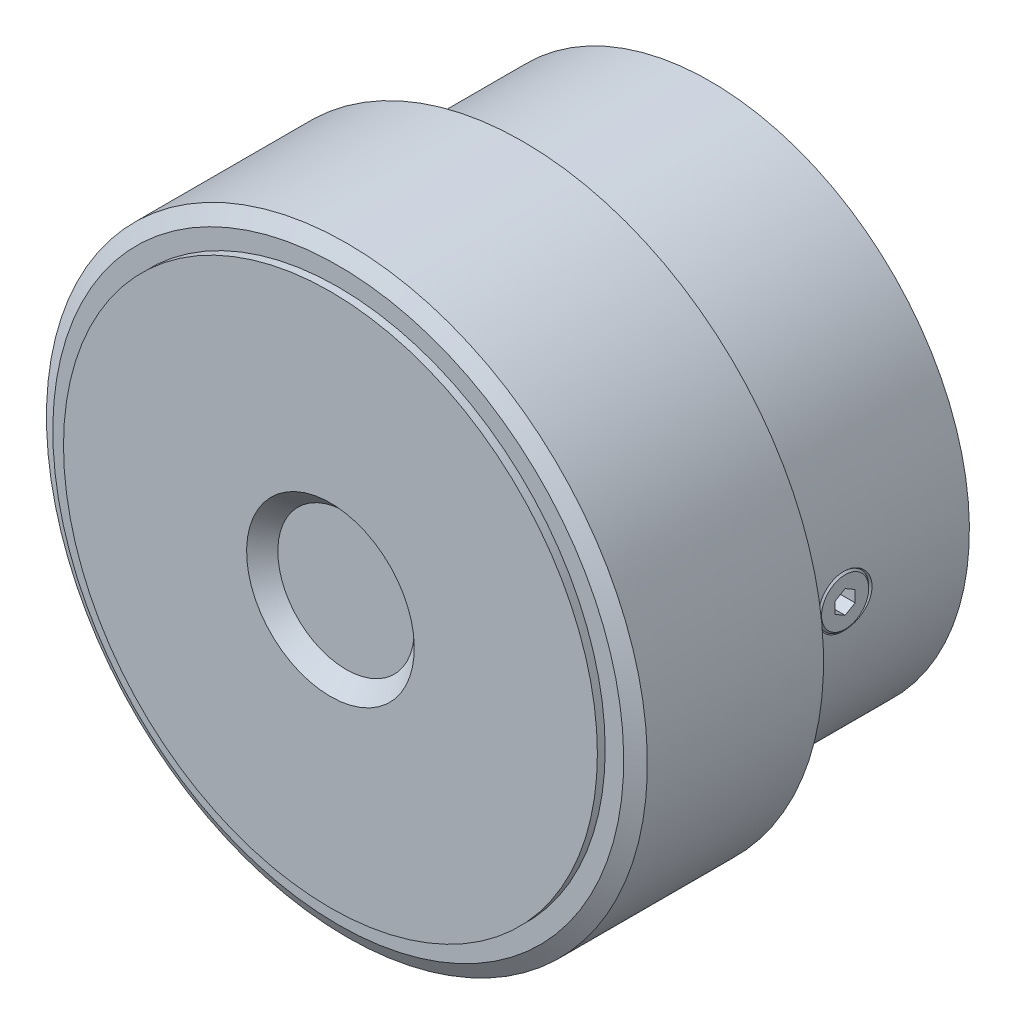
ISO-10303-21;
HEADER;
FILE_DESCRIPTION(('STEP AP214'),'2;1');
FILE_NAME('part.step','',(''),(''),'','','');
FILE_SCHEMA(('AUTOMOTIVE_DESIGN { 1 0 10303 214 1 1 1 1 }'));
ENDSEC;
DATA;
#1=APPLICATION_CONTEXT('core data for automotive mechanical design processes');
#2=APPLICATION_PROTOCOL_DEFINITION('international standard','automotive_design',2000,#1);
#3=PRODUCT_CONTEXT('',#1,'mechanical');
#4=PRODUCT('Part','Part','',(#3));
#5=PRODUCT_RELATED_PRODUCT_CATEGORY('part','',(#4));
#6=PRODUCT_DEFINITION_FORMATION('','',#4);
#7=PRODUCT_DEFINITION_CONTEXT('part definition',#1,'design');
#8=PRODUCT_DEFINITION('design','',#6,#7);
#9=PRODUCT_DEFINITION_SHAPE('','',#8);
#10=(LENGTH_UNIT() NAMED_UNIT(*) SI_UNIT(.MILLI.,.METRE.));
#11=(NAMED_UNIT(*) PLANE_ANGLE_UNIT() SI_UNIT($,.RADIAN.));
#12=(NAMED_UNIT(*) SI_UNIT($,.STERADIAN.) SOLID_ANGLE_UNIT());
#13=UNCERTAINTY_MEASURE_WITH_UNIT(LENGTH_MEASURE(1.E-05),#10,'distance_accuracy_value','');
#14=(GEOMETRIC_REPRESENTATION_CONTEXT(3) GLOBAL_UNCERTAINTY_ASSIGNED_CONTEXT((#13)) GLOBAL_UNIT_ASSIGNED_CONTEXT((#10,
#11,#12)) REPRESENTATION_CONTEXT('',''));
#15=CARTESIAN_POINT('',(0.,0.,0.));
#16=DIRECTION('',(0.,0.,1.));
#17=DIRECTION('',(1.,0.,0.));
#18=AXIS2_PLACEMENT_3D('',#15,#16,#17);
#19=CARTESIAN_POINT('',(17.45,0.,9.));
#20=DIRECTION('',(1.,0.,0.));
#21=DIRECTION('',(0.,0.,-1.));
#22=AXIS2_PLACEMENT_3D('',#19,#20,#21);
#23=CONICAL_SURFACE('',#22,2.,0.785398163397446);
#24=CARTESIAN_POINT('',(17.2061921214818,-1.22859785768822,7.7451063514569));
#25=CARTESIAN_POINT('',(17.2104098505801,-1.16952644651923,7.68137068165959));
#26=CARTESIAN_POINT('',(17.2146587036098,-1.10573725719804,7.62199444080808));
#27=CARTESIAN_POINT('',(17.2228450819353,-0.96991517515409,7.51346370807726));
#28=CARTESIAN_POINT('',(17.2267824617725,-0.897878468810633,7.46431397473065));
#29=CARTESIAN_POINT('',(17.2344139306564,-0.737976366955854,7.372427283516));
#30=CARTESIAN_POINT('',(17.2380219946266,-0.649249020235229,7.33116963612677));
#31=CARTESIAN_POINT('',(17.2439514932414,-0.465876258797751,7.26485773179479));
#32=CARTESIAN_POINT('',(17.24627290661,-0.371230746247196,7.2398037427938));
#33=CARTESIAN_POINT('',(17.249273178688,-0.183131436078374,7.20764057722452));
#34=CARTESIAN_POINT('',(17.2500187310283,-0.0898031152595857,7.19980220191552));
#35=CARTESIAN_POINT('',(17.2499805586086,0.0968043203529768,7.20020531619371));
#36=CARTESIAN_POINT('',(17.249197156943,0.190083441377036,7.2084434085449));
#37=CARTESIAN_POINT('',(17.2462249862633,0.371925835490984,7.2403300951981));
#38=CARTESIAN_POINT('',(17.2440658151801,0.460546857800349,7.26365428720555));
#39=CARTESIAN_POINT('',(17.2386081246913,0.632704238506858,7.32454932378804));
#40=CARTESIAN_POINT('',(17.2353095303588,0.716240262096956,7.36212110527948));
#41=CARTESIAN_POINT('',(17.2278575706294,0.877533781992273,7.45102359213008));
#42=CARTESIAN_POINT('',(17.2236900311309,0.95516190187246,7.50258737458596));
#43=CARTESIAN_POINT('',(17.2149764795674,1.10110874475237,7.61749740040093));
#44=CARTESIAN_POINT('',(17.2104303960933,1.16942570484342,7.68084586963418));
#45=CARTESIAN_POINT('',(17.2012193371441,1.2980367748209,7.82048865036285));
#46=CARTESIAN_POINT('',(17.1965579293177,1.35784573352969,7.89722987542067));
#47=CARTESIAN_POINT('',(17.1878114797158,1.4644122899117,8.05931965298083));
#48=CARTESIAN_POINT('',(17.1837265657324,1.51116699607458,8.144670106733));
#49=CARTESIAN_POINT('',(17.1763831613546,1.59251852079,8.32578252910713));
#50=CARTESIAN_POINT('',(17.1731714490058,1.62645551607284,8.42184307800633));
#51=CARTESIAN_POINT('',(17.1681818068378,1.67830719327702,8.61823209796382));
#52=CARTESIAN_POINT('',(17.1664041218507,1.69621913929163,8.71856129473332));
#53=CARTESIAN_POINT('',(17.1644443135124,1.71594236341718,8.92383024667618));
#54=CARTESIAN_POINT('',(17.1643112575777,1.71725853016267,9.02881834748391));
#55=CARTESIAN_POINT('',(17.1657834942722,1.70247747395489,9.23755670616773));
#56=CARTESIAN_POINT('',(17.1673889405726,1.68637871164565,9.34130685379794));
#57=CARTESIAN_POINT('',(17.172174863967,1.63692652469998,9.54539605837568));
#58=CARTESIAN_POINT('',(17.1753668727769,1.6034466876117,9.64570430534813));
#59=CARTESIAN_POINT('',(17.1829609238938,1.51990264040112,9.83912569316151));
#60=CARTESIAN_POINT('',(17.1873629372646,1.46983882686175,9.93223900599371));
#61=CARTESIAN_POINT('',(17.1967755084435,1.35523189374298,10.1069272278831));
#62=CARTESIAN_POINT('',(17.2017751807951,1.29093372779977,10.1886631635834));
#63=CARTESIAN_POINT('',(17.2118370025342,1.14900408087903,10.3396117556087));
#64=CARTESIAN_POINT('',(17.2168991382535,1.0713754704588,10.4088271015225));
#65=CARTESIAN_POINT('',(17.2262619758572,0.908186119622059,10.5297682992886));
#66=CARTESIAN_POINT('',(17.2305848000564,0.823057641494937,10.5820751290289));
#67=CARTESIAN_POINT('',(17.2381728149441,0.644848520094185,10.6708131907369));
#68=CARTESIAN_POINT('',(17.2414383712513,0.551770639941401,10.7072499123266));
#69=CARTESIAN_POINT('',(17.246371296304,0.365293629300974,10.7613802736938));
#70=CARTESIAN_POINT('',(17.2481100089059,0.27214022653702,10.7799152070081));
#71=CARTESIAN_POINT('',(17.2500515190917,0.0840215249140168,10.8005757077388));
#72=CARTESIAN_POINT('',(17.2502546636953,-0.010943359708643,10.8027049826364));
#73=CARTESIAN_POINT('',(17.2491202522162,-0.196755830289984,10.7906736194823));
#74=CARTESIAN_POINT('',(17.2478318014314,-0.287637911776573,10.7770321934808));
#75=CARTESIAN_POINT('',(17.2439395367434,-0.465827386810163,10.7348207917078));
#76=CARTESIAN_POINT('',(17.2413357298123,-0.55313479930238,10.7062508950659));
#77=CARTESIAN_POINT('',(17.2350798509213,-0.722313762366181,10.6350033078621));
#78=CARTESIAN_POINT('',(17.2314219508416,-0.804151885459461,10.5922469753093));
#79=CARTESIAN_POINT('',(17.2234529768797,-0.959819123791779,10.494100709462));
#80=CARTESIAN_POINT('',(17.2191418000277,-1.03364697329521,10.4387087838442));
#81=CARTESIAN_POINT('',(17.2101368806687,-1.17424275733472,10.3146606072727));
#82=CARTESIAN_POINT('',(17.2054348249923,-1.24063557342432,10.2455801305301));
#83=CARTESIAN_POINT('',(17.1962916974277,-1.36151974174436,10.0976817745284));
#84=CARTESIAN_POINT('',(17.1918506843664,-1.41600841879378,10.0188617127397));
#85=CARTESIAN_POINT('',(17.1834810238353,-1.51427760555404,9.84966040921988));
#86=CARTESIAN_POINT('',(17.1795871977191,-1.55741865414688,9.75890585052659));
#87=CARTESIAN_POINT('',(17.1729949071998,-1.62850393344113,9.57159046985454));
#88=CARTESIAN_POINT('',(17.1702966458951,-1.65644558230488,9.47502866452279));
#89=CARTESIAN_POINT('',(17.1663080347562,-1.69729562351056,9.27509435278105));
#90=CARTESIAN_POINT('',(17.16507215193,-1.70962357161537,9.17160183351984));
#91=CARTESIAN_POINT('',(17.1643264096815,-1.71709415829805,8.96397137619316));
#92=CARTESIAN_POINT('',(17.1648169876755,-1.71223244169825,8.85983328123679));
#93=CARTESIAN_POINT('',(17.1674902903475,-1.6852191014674,8.65225409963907));
#94=CARTESIAN_POINT('',(17.1696982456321,-1.66280964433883,8.54884680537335));
#95=CARTESIAN_POINT('',(17.1755833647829,-1.60087403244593,8.34737140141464));
#96=CARTESIAN_POINT('',(17.1792595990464,-1.56135870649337,8.24929995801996));
#97=CARTESIAN_POINT('',(17.1867804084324,-1.4759754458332,8.0808203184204));
#98=CARTESIAN_POINT('',(17.1904343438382,-1.43309244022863,8.00887492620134));
#99=CARTESIAN_POINT('',(17.1981134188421,-1.3377887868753,7.87164808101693));
#100=CARTESIAN_POINT('',(17.2021383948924,-1.28537233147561,7.80636371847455));
#101=CARTESIAN_POINT('',(17.2061921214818,-1.22859785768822,7.7451063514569));
#102=B_SPLINE_CURVE_WITH_KNOTS('',3,(#24,#25,#26,#27,#28,#29,#30,#31,#32,#33,#34,#35,#36,#37,
#38,#39,#40,#41,#42,#43,#44,#45,#46,#47,#48,#49,#50,#51,#52,#53,#54,#55,#56,#57,#58,#59,#60,#61,
#62,#63,#64,#65,#66,#67,#68,#69,#70,#71,#72,#73,#74,#75,#76,#77,#78,#79,#80,#81,#82,#83,#84,#85,
#86,#87,#88,#89,#90,#91,#92,#93,#94,#95,#96,#97,#98,#99,#100,#101),.UNSPECIFIED.,.T.,.F.,(4,2,2,
2,2,2,2,2,2,2,2,2,2,2,2,2,2,2,2,2,2,2,2,2,2,2,2,2,2,2,2,2,2,2,2,2,2,2,4),(0.,0.260775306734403,
0.521671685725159,0.813904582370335,1.1061423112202,1.38574167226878,1.6652819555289,
1.93900248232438,2.21274101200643,2.49135368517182,2.77001903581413,3.06094336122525,
3.35193207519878,3.6563350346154,3.96078995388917,4.27430707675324,4.58785191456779,
4.90370978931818,5.21956011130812,5.53034762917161,5.84106830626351,6.13956364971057,
6.4379556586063,6.72152223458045,7.00502472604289,7.27945311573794,7.5538800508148,
7.8298544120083,8.10587231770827,8.39238400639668,8.67896001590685,8.97929036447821,
9.27967171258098,9.5909202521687,9.90224765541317,10.2182373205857,10.5340272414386,
10.7847725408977,11.0354078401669),.UNSPECIFIED.);
#103=CARTESIAN_POINT('',(17.2061921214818,-1.22859785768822,7.7451063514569));
#104=VERTEX_POINT('',#103);
#105=EDGE_CURVE('E18',#104,#104,#102,.T.);
#106=ORIENTED_EDGE('',*,*,#105,.T.);
#107=EDGE_LOOP('',(#106));
#108=FACE_BOUND('',#107,.T.);
#109=CARTESIAN_POINT('',(17.139,0.,9.));
#110=DIRECTION('',(1.,0.,0.));
#111=DIRECTION('',(0.,0.,-1.));
#112=AXIS2_PLACEMENT_3D('',#109,#110,#111);
#113=CIRCLE('',#112,1.689);
#114=CARTESIAN_POINT('',(17.139,0.,7.311));
#115=VERTEX_POINT('',#114);
#116=EDGE_CURVE('E9',#115,#115,#113,.T.);
#117=ORIENTED_EDGE('',*,*,#116,.F.);
#118=EDGE_LOOP('',(#117));
#119=FACE_BOUND('',#118,.T.);
#120=ADVANCED_FACE('F14',(#108,#119),#23,.F.);
#121=CARTESIAN_POINT('',(0.,0.,0.));
#122=DIRECTION('',(0.,0.,1.));
#123=DIRECTION('',(0.,-1.,0.));
#124=AXIS2_PLACEMENT_3D('',#121,#122,#123);
#125=PLANE('',#124);
#126=CARTESIAN_POINT('',(0.,0.,0.));
#127=DIRECTION('',(0.,0.,1.));
#128=DIRECTION('',(0.,-1.,0.));
#129=AXIS2_PLACEMENT_3D('',#126,#127,#128);
#130=CIRCLE('',#129,6.);
#131=CARTESIAN_POINT('',(0.,-6.,0.));
#132=VERTEX_POINT('',#131);
#133=EDGE_CURVE('E97',#132,#132,#130,.T.);
#134=ORIENTED_EDGE('',*,*,#133,.F.);
#135=EDGE_LOOP('',(#134));
#136=FACE_BOUND('',#135,.T.);
#137=CARTESIAN_POINT('',(0.,0.,0.));
#138=DIRECTION('',(0.,0.,1.));
#139=DIRECTION('',(0.,-1.,0.));
#140=AXIS2_PLACEMENT_3D('',#137,#138,#139);
#141=CIRCLE('',#140,3.2);
#142=CARTESIAN_POINT('',(0.,-3.2,0.));
#143=VERTEX_POINT('',#142);
#144=EDGE_CURVE('E145',#143,#143,#141,.T.);
#145=ORIENTED_EDGE('',*,*,#144,.T.);
#146=EDGE_LOOP('',(#145));
#147=FACE_BOUND('',#146,.T.);
#148=ADVANCED_FACE('F185',(#136,#147),#125,.F.);
#149=CARTESIAN_POINT('',(0.,0.,26.));
#150=DIRECTION('',(0.,0.,1.));
#151=DIRECTION('',(0.,-1.,0.));
#152=AXIS2_PLACEMENT_3D('',#149,#150,#151);
#153=CYLINDRICAL_SURFACE('',#152,6.);
#154=CARTESIAN_POINT('',(0.,0.,0.3));
#155=DIRECTION('',(0.,0.,1.));
#156=DIRECTION('',(0.,-1.,0.));
#157=AXIS2_PLACEMENT_3D('',#154,#155,#156);
#158=CIRCLE('',#157,6.);
#159=CARTESIAN_POINT('',(0.,-6.,0.3));
#160=VERTEX_POINT('',#159);
#161=EDGE_CURVE('E178',#160,#160,#158,.T.);
#162=ORIENTED_EDGE('',*,*,#161,.F.);
#163=EDGE_LOOP('',(#162));
#164=FACE_BOUND('',#163,.T.);
#165=ORIENTED_EDGE('',*,*,#133,.T.);
#166=EDGE_LOOP('',(#165));
#167=FACE_BOUND('',#166,.T.);
#168=ADVANCED_FACE('F183',(#164,#167),#153,.T.);
#169=CARTESIAN_POINT('',(0.,0.,0.));
#170=DIRECTION('',(0.,0.,-1.));
#171=DIRECTION('',(0.,1.,0.));
#172=AXIS2_PLACEMENT_3D('',#169,#170,#171);
#173=CONICAL_SURFACE('',#172,3.2,0.785398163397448);
#174=CARTESIAN_POINT('',(0.,0.,0.2));
#175=DIRECTION('',(0.,0.,1.));
#176=DIRECTION('',(0.,-1.,0.));
#177=AXIS2_PLACEMENT_3D('',#174,#175,#176);
#178=CIRCLE('',#177,3.);
#179=CARTESIAN_POINT('',(0.,-3.,0.2));
#180=VERTEX_POINT('',#179);
#181=EDGE_CURVE('E142',#180,#180,#178,.T.);
#182=ORIENTED_EDGE('',*,*,#181,.T.);
#183=EDGE_LOOP('',(#182));
#184=FACE_BOUND('',#183,.T.);
#185=ORIENTED_EDGE('',*,*,#144,.F.);
#186=EDGE_LOOP('',(#185));
#187=FACE_BOUND('',#186,.T.);
#188=ADVANCED_FACE('F190',(#184,#187),#173,.F.);
#189=CARTESIAN_POINT('',(6.,0.,0.3));
#190=DIRECTION('',(0.,0.,1.));
#191=DIRECTION('',(0.,-1.,0.));
#192=AXIS2_PLACEMENT_3D('',#189,#190,#191);
#193=PLANE('',#192);
#194=CARTESIAN_POINT('',(0.,0.,0.3));
#195=DIRECTION('',(0.,0.,1.));
#196=DIRECTION('',(0.,-1.,0.));
#197=AXIS2_PLACEMENT_3D('',#194,#195,#196);
#198=CIRCLE('',#197,8.);
#199=CARTESIAN_POINT('',(0.,-8.,0.3));
#200=VERTEX_POINT('',#199);
#201=EDGE_CURVE('E175',#200,#200,#198,.T.);
#202=ORIENTED_EDGE('',*,*,#201,.F.);
#203=EDGE_LOOP('',(#202));
#204=FACE_BOUND('',#203,.T.);
#205=ORIENTED_EDGE('',*,*,#161,.T.);
#206=EDGE_LOOP('',(#205));
#207=FACE_BOUND('',#206,.T.);
#208=ADVANCED_FACE('F192',(#204,#207),#193,.F.);
#209=CARTESIAN_POINT('',(0.,0.,15.7320508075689));
#210=DIRECTION('',(0.,0.,1.));
#211=DIRECTION('',(0.,-1.,0.));
#212=AXIS2_PLACEMENT_3D('',#209,#210,#211);
#213=CYLINDRICAL_SURFACE('',#212,3.);
#214=ORIENTED_EDGE('',*,*,#181,.F.);
#215=EDGE_LOOP('',(#214));
#216=FACE_BOUND('',#215,.T.);
#217=CARTESIAN_POINT('',(0.,0.,14.));
#218=DIRECTION('',(0.,0.,-1.));
#219=DIRECTION('',(0.,1.,0.));
#220=AXIS2_PLACEMENT_3D('',#217,#218,#219);
#221=CIRCLE('',#220,3.);
#222=CARTESIAN_POINT('',(0.,3.,14.));
#223=VERTEX_POINT('',#222);
#224=EDGE_CURVE('E99',#223,#223,#221,.T.);
#225=ORIENTED_EDGE('',*,*,#224,.F.);
#226=EDGE_LOOP('',(#225));
#227=FACE_BOUND('',#226,.T.);
#228=ADVANCED_FACE('F200',(#216,#227),#213,.F.);
#229=CARTESIAN_POINT('',(0.,0.,26.));
#230=DIRECTION('',(0.,0.,1.));
#231=DIRECTION('',(0.,-1.,0.));
#232=AXIS2_PLACEMENT_3D('',#229,#230,#231);
#233=CYLINDRICAL_SURFACE('',#232,8.);
#234=CARTESIAN_POINT('',(0.,0.,0.72));
#235=DIRECTION('',(0.,0.,1.));
#236=DIRECTION('',(0.,-1.,0.));
#237=AXIS2_PLACEMENT_3D('',#234,#235,#236);
#238=CIRCLE('',#237,8.);
#239=CARTESIAN_POINT('',(0.,-8.,0.72));
#240=VERTEX_POINT('',#239);
#241=EDGE_CURVE('E172',#240,#240,#238,.T.);
#242=ORIENTED_EDGE('',*,*,#241,.F.);
#243=EDGE_LOOP('',(#242));
#244=FACE_BOUND('',#243,.T.);
#245=ORIENTED_EDGE('',*,*,#201,.T.);
#246=EDGE_LOOP('',(#245));
#247=FACE_BOUND('',#246,.T.);
#248=ADVANCED_FACE('F255',(#244,#247),#233,.T.);
#249=CARTESIAN_POINT('',(8.,0.,0.72));
#250=DIRECTION('',(0.,0.,1.));
#251=DIRECTION('',(0.,-1.,0.));
#252=AXIS2_PLACEMENT_3D('',#249,#250,#251);
#253=PLANE('',#252);
#254=CARTESIAN_POINT('',(0.,0.,0.72));
#255=DIRECTION('',(0.,0.,1.));
#256=DIRECTION('',(0.,-1.,0.));
#257=AXIS2_PLACEMENT_3D('',#254,#255,#256);
#258=CIRCLE('',#257,17.25);
#259=CARTESIAN_POINT('',(0.,-17.25,0.72));
#260=VERTEX_POINT('',#259);
#261=EDGE_CURVE('E169',#260,#260,#258,.T.);
#262=ORIENTED_EDGE('',*,*,#261,.F.);
#263=EDGE_LOOP('',(#262));
#264=FACE_BOUND('',#263,.T.);
#265=ORIENTED_EDGE('',*,*,#241,.T.);
#266=EDGE_LOOP('',(#265));
#267=FACE_BOUND('',#266,.T.);
#268=ADVANCED_FACE('F251',(#264,#267),#253,.F.);
#269=CARTESIAN_POINT('',(0.,0.,26.));
#270=DIRECTION('',(0.,0.,1.));
#271=DIRECTION('',(0.,-1.,0.));
#272=AXIS2_PLACEMENT_3D('',#269,#270,#271);
#273=CYLINDRICAL_SURFACE('',#272,17.25);
#274=CARTESIAN_POINT('',(0.,0.,12.));
#275=DIRECTION('',(0.,0.,1.));
#276=DIRECTION('',(0.,-1.,0.));
#277=AXIS2_PLACEMENT_3D('',#274,#275,#276);
#278=CIRCLE('',#277,17.25);
#279=CARTESIAN_POINT('',(0.,-17.25,12.));
#280=VERTEX_POINT('',#279);
#281=EDGE_CURVE('E166',#280,#280,#278,.T.);
#282=ORIENTED_EDGE('',*,*,#281,.F.);
#283=EDGE_LOOP('',(#282));
#284=FACE_BOUND('',#283,.T.);
#285=ORIENTED_EDGE('',*,*,#105,.F.);
#286=EDGE_LOOP('',(#285));
#287=FACE_BOUND('',#286,.T.);
#288=ORIENTED_EDGE('',*,*,#261,.T.);
#289=EDGE_LOOP('',(#288));
#290=FACE_BOUND('',#289,.T.);
#291=ADVANCED_FACE('F246',(#284,#287,#290),#273,.T.);
#292=CARTESIAN_POINT('',(17.25,0.,12.));
#293=DIRECTION('',(0.,0.,1.));
#294=DIRECTION('',(0.,-1.,0.));
#295=AXIS2_PLACEMENT_3D('',#292,#293,#294);
#296=PLANE('',#295);
#297=CARTESIAN_POINT('',(0.,0.,12.));
#298=DIRECTION('',(0.,0.,1.));
#299=DIRECTION('',(0.,-1.,0.));
#300=AXIS2_PLACEMENT_3D('',#297,#298,#299);
#301=CIRCLE('',#300,17.7675);
#302=CARTESIAN_POINT('',(0.,-17.7675,12.));
#303=VERTEX_POINT('',#302);
#304=EDGE_CURVE('E163',#303,#303,#301,.T.);
#305=ORIENTED_EDGE('',*,*,#304,.F.);
#306=EDGE_LOOP('',(#305));
#307=FACE_BOUND('',#306,.T.);
#308=ORIENTED_EDGE('',*,*,#281,.T.);
#309=EDGE_LOOP('',(#308));
#310=FACE_BOUND('',#309,.T.);
#311=ADVANCED_FACE('F243',(#307,#310),#296,.F.);
#312=CARTESIAN_POINT('',(0.,0.,26.));
#313=DIRECTION('',(0.,0.,1.));
#314=DIRECTION('',(0.,-1.,0.));
#315=AXIS2_PLACEMENT_3D('',#312,#313,#314);
#316=CYLINDRICAL_SURFACE('',#315,17.7675);
#317=CARTESIAN_POINT('',(0.,0.,12.6));
#318=DIRECTION('',(0.,0.,1.));
#319=DIRECTION('',(0.,-1.,0.));
#320=AXIS2_PLACEMENT_3D('',#317,#318,#319);
#321=CIRCLE('',#320,17.7675);
#322=CARTESIAN_POINT('',(0.,-17.7675,12.6));
#323=VERTEX_POINT('',#322);
#324=EDGE_CURVE('E160',#323,#323,#321,.T.);
#325=ORIENTED_EDGE('',*,*,#324,.F.);
#326=EDGE_LOOP('',(#325));
#327=FACE_BOUND('',#326,.T.);
#328=ORIENTED_EDGE('',*,*,#304,.T.);
#329=EDGE_LOOP('',(#328));
#330=FACE_BOUND('',#329,.T.);
#331=ADVANCED_FACE('F239',(#327,#330),#316,.T.);
#332=CARTESIAN_POINT('',(17.7675,0.,12.6));
#333=DIRECTION('',(0.,0.,1.));
#334=DIRECTION('',(0.,-1.,0.));
#335=AXIS2_PLACEMENT_3D('',#332,#333,#334);
#336=PLANE('',#335);
#337=CARTESIAN_POINT('',(0.,0.,12.6));
#338=DIRECTION('',(0.,0.,1.));
#339=DIRECTION('',(0.,-1.,0.));
#340=AXIS2_PLACEMENT_3D('',#337,#338,#339);
#341=CIRCLE('',#340,19.);
#342=CARTESIAN_POINT('',(0.,-19.,12.6));
#343=VERTEX_POINT('',#342);
#344=EDGE_CURVE('E133',#343,#343,#341,.T.);
#345=ORIENTED_EDGE('',*,*,#344,.F.);
#346=EDGE_LOOP('',(#345));
#347=FACE_BOUND('',#346,.T.);
#348=ORIENTED_EDGE('',*,*,#324,.T.);
#349=EDGE_LOOP('',(#348));
#350=FACE_BOUND('',#349,.T.);
#351=ADVANCED_FACE('F236',(#347,#350),#336,.F.);
#352=CARTESIAN_POINT('',(0.,0.,12.6));
#353=DIRECTION('',(0.,0.,1.));
#354=DIRECTION('',(0.,-1.,0.));
#355=AXIS2_PLACEMENT_3D('',#352,#353,#354);
#356=CONICAL_SURFACE('',#355,19.,1.0471975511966);
#357=CARTESIAN_POINT('',(0.,0.,13.1773502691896));
#358=DIRECTION('',(0.,0.,1.));
#359=DIRECTION('',(0.,-1.,0.));
#360=AXIS2_PLACEMENT_3D('',#357,#358,#359);
#361=CIRCLE('',#360,20.);
#362=CARTESIAN_POINT('',(0.,-20.,13.1773502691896));
#363=VERTEX_POINT('',#362);
#364=EDGE_CURVE('E139',#363,#363,#361,.T.);
#365=ORIENTED_EDGE('',*,*,#364,.F.);
#366=EDGE_LOOP('',(#365));
#367=FACE_BOUND('',#366,.T.);
#368=ORIENTED_EDGE('',*,*,#344,.T.);
#369=EDGE_LOOP('',(#368));
#370=FACE_BOUND('',#369,.T.);
#371=ADVANCED_FACE('F234',(#367,#370),#356,.T.);
#372=CARTESIAN_POINT('',(0.,0.,26.));
#373=DIRECTION('',(0.,0.,1.));
#374=DIRECTION('',(0.,-1.,0.));
#375=AXIS2_PLACEMENT_3D('',#372,#373,#374);
#376=CYLINDRICAL_SURFACE('',#375,20.);
#377=ORIENTED_EDGE('',*,*,#364,.T.);
#378=EDGE_LOOP('',(#377));
#379=FACE_BOUND('',#378,.T.);
#380=CARTESIAN_POINT('',(0.,0.,24.9026497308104));
#381=DIRECTION('',(0.,0.,-1.));
#382=DIRECTION('',(0.,1.,0.));
#383=AXIS2_PLACEMENT_3D('',#380,#381,#382);
#384=CIRCLE('',#383,20.);
#385=CARTESIAN_POINT('',(0.,20.,24.9026497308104));
#386=VERTEX_POINT('',#385);
#387=EDGE_CURVE('E136',#386,#386,#384,.T.);
#388=ORIENTED_EDGE('',*,*,#387,.T.);
#389=EDGE_LOOP('',(#388));
#390=FACE_BOUND('',#389,.T.);
#391=ADVANCED_FACE('F230',(#379,#390),#376,.T.);
#392=CARTESIAN_POINT('',(17.2575,0.,9.));
#393=DIRECTION('',(-1.,0.,0.));
#394=DIRECTION('',(0.,-1.,0.));
#395=AXIS2_PLACEMENT_3D('',#392,#393,#394);
#396=PLANE('',#395);
#397=CARTESIAN_POINT('',(17.2575,0.,9.));
#398=DIRECTION('',(-1.,0.,0.));
#399=DIRECTION('',(0.,-1.,0.));
#400=AXIS2_PLACEMENT_3D('',#397,#398,#399);
#401=CIRCLE('',#400,1.5705);
#402=CARTESIAN_POINT('',(17.2575,-1.5705,9.));
#403=VERTEX_POINT('',#402);
#404=EDGE_CURVE('E79',#403,#403,#401,.T.);
#405=ORIENTED_EDGE('',*,*,#404,.F.);
#406=EDGE_LOOP('',(#405));
#407=FACE_BOUND('',#406,.T.);
#408=DIRECTION('',(0.,1.,0.));
#409=VECTOR('',#408,1.);
#410=CARTESIAN_POINT('',(17.2575,0.,8.33333333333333));
#411=LINE('',#410,#409);
#412=CARTESIAN_POINT('',(17.2575,-0.384900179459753,8.33333333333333));
#413=VERTEX_POINT('',#412);
#414=CARTESIAN_POINT('',(17.2575,0.384900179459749,8.33333333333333));
#415=VERTEX_POINT('',#414);
#416=EDGE_CURVE('E28',#413,#415,#411,.T.);
#417=ORIENTED_EDGE('',*,*,#416,.F.);
#418=DIRECTION('',(0.,0.5,-0.866025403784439));
#419=VECTOR('',#418,1.);
#420=CARTESIAN_POINT('',(17.2575,-0.577350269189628,8.66666666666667));
#421=LINE('',#420,#419);
#422=CARTESIAN_POINT('',(17.2575,-0.769800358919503,9.));
#423=VERTEX_POINT('',#422);
#424=EDGE_CURVE('E118',#423,#413,#421,.T.);
#425=ORIENTED_EDGE('',*,*,#424,.F.);
#426=DIRECTION('',(0.,-0.5,-0.866025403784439));
#427=VECTOR('',#426,1.);
#428=CARTESIAN_POINT('',(17.2575,-0.577350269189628,9.33333333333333));
#429=LINE('',#428,#427);
#430=CARTESIAN_POINT('',(17.2575,-0.384900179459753,9.66666666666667));
#431=VERTEX_POINT('',#430);
#432=EDGE_CURVE('E120',#431,#423,#429,.T.);
#433=ORIENTED_EDGE('',*,*,#432,.F.);
#434=DIRECTION('',(0.,-1.,0.));
#435=VECTOR('',#434,1.);
#436=CARTESIAN_POINT('',(17.2575,0.,9.66666666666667));
#437=LINE('',#436,#435);
#438=CARTESIAN_POINT('',(17.2575,0.384900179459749,9.66666666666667));
#439=VERTEX_POINT('',#438);
#440=EDGE_CURVE('E122',#439,#431,#437,.T.);
#441=ORIENTED_EDGE('',*,*,#440,.F.);
#442=DIRECTION('',(0.,-0.5,0.866025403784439));
#443=VECTOR('',#442,1.);
#444=CARTESIAN_POINT('',(17.2575,0.577350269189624,9.33333333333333));
#445=LINE('',#444,#443);
#446=CARTESIAN_POINT('',(17.2575,0.769800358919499,9.));
#447=VERTEX_POINT('',#446);
#448=EDGE_CURVE('E124',#447,#439,#445,.T.);
#449=ORIENTED_EDGE('',*,*,#448,.F.);
#450=DIRECTION('',(0.,0.5,0.866025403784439));
#451=VECTOR('',#450,1.);
#452=CARTESIAN_POINT('',(17.2575,0.577350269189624,8.66666666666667));
#453=LINE('',#452,#451);
#454=EDGE_CURVE('E127',#415,#447,#453,.T.);
#455=ORIENTED_EDGE('',*,*,#454,.F.);
#456=EDGE_LOOP('',(#417,#425,#433,#441,#449,#455));
#457=FACE_BOUND('',#456,.T.);
#458=ADVANCED_FACE('F233',(#407,#457),#396,.F.);
#459=CARTESIAN_POINT('',(17.2575,0.,9.));
#460=DIRECTION('',(-1.,0.,0.));
#461=DIRECTION('',(0.,-1.,0.));
#462=AXIS2_PLACEMENT_3D('',#459,#460,#461);
#463=CONICAL_SURFACE('',#462,1.5705,0.785398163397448);
#464=ORIENTED_EDGE('',*,*,#116,.T.);
#465=EDGE_LOOP('',(#464));
#466=FACE_BOUND('',#465,.T.);
#467=ORIENTED_EDGE('',*,*,#404,.T.);
#468=EDGE_LOOP('',(#467));
#469=FACE_BOUND('',#468,.T.);
#470=ADVANCED_FACE('F282',(#466,#469),#463,.T.);
#471=CARTESIAN_POINT('',(19.25,-0.384900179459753,8.33333333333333));
#472=DIRECTION('',(0.,0.,1.));
#473=DIRECTION('',(0.,-1.,0.));
#474=AXIS2_PLACEMENT_3D('',#471,#472,#473);
#475=PLANE('',#474);
#476=ORIENTED_EDGE('',*,*,#416,.T.);
#477=DIRECTION('',(-1.,0.,0.));
#478=VECTOR('',#477,1.);
#479=CARTESIAN_POINT('',(19.25,0.384900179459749,8.33333333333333));
#480=LINE('',#479,#478);
#481=CARTESIAN_POINT('',(15.25,0.384900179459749,8.33333333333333));
#482=VERTEX_POINT('',#481);
#483=EDGE_CURVE('E72',#415,#482,#480,.T.);
#484=ORIENTED_EDGE('',*,*,#483,.T.);
#485=DIRECTION('',(0.,1.,0.));
#486=VECTOR('',#485,1.);
#487=CARTESIAN_POINT('',(15.25,-0.384900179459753,8.33333333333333));
#488=LINE('',#487,#486);
#489=CARTESIAN_POINT('',(15.25,-0.384900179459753,8.33333333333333));
#490=VERTEX_POINT('',#489);
#491=EDGE_CURVE('E76',#490,#482,#488,.T.);
#492=ORIENTED_EDGE('',*,*,#491,.F.);
#493=DIRECTION('',(-1.,0.,0.));
#494=VECTOR('',#493,1.);
#495=CARTESIAN_POINT('',(19.25,-0.384900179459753,8.33333333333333));
#496=LINE('',#495,#494);
#497=EDGE_CURVE('E108',#413,#490,#496,.T.);
#498=ORIENTED_EDGE('',*,*,#497,.F.);
#499=EDGE_LOOP('',(#476,#484,#492,#498));
#500=FACE_BOUND('',#499,.T.);
#501=ADVANCED_FACE('F74',(#500),#475,.T.);
#502=CARTESIAN_POINT('',(19.25,0.384900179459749,8.33333333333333));
#503=DIRECTION('',(0.,-0.866025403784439,0.5));
#504=DIRECTION('',(0.,-0.5,-0.866025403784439));
#505=AXIS2_PLACEMENT_3D('',#502,#503,#504);
#506=PLANE('',#505);
#507=ORIENTED_EDGE('',*,*,#454,.T.);
#508=DIRECTION('',(-1.,0.,0.));
#509=VECTOR('',#508,1.);
#510=CARTESIAN_POINT('',(19.25,0.769800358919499,9.));
#511=LINE('',#510,#509);
#512=CARTESIAN_POINT('',(15.25,0.769800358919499,9.));
#513=VERTEX_POINT('',#512);
#514=EDGE_CURVE('E80',#447,#513,#511,.T.);
#515=ORIENTED_EDGE('',*,*,#514,.T.);
#516=DIRECTION('',(0.,0.5,0.866025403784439));
#517=VECTOR('',#516,1.);
#518=CARTESIAN_POINT('',(15.25,0.384900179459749,8.33333333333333));
#519=LINE('',#518,#517);
#520=EDGE_CURVE('E83',#482,#513,#519,.T.);
#521=ORIENTED_EDGE('',*,*,#520,.F.);
#522=ORIENTED_EDGE('',*,*,#483,.F.);
#523=EDGE_LOOP('',(#507,#515,#521,#522));
#524=FACE_BOUND('',#523,.T.);
#525=ADVANCED_FACE('F84',(#524),#506,.T.);
#526=CARTESIAN_POINT('',(19.25,0.769800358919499,9.));
#527=DIRECTION('',(0.,-0.866025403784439,-0.5));
#528=DIRECTION('',(0.,0.5,-0.866025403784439));
#529=AXIS2_PLACEMENT_3D('',#526,#527,#528);
#530=PLANE('',#529);
#531=ORIENTED_EDGE('',*,*,#448,.T.);
#532=DIRECTION('',(-1.,0.,0.));
#533=VECTOR('',#532,1.);
#534=CARTESIAN_POINT('',(19.25,0.384900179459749,9.66666666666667));
#535=LINE('',#534,#533);
#536=CARTESIAN_POINT('',(15.25,0.384900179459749,9.66666666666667));
#537=VERTEX_POINT('',#536);
#538=EDGE_CURVE('E113',#439,#537,#535,.T.);
#539=ORIENTED_EDGE('',*,*,#538,.T.);
#540=DIRECTION('',(0.,-0.5,0.866025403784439));
#541=VECTOR('',#540,1.);
#542=CARTESIAN_POINT('',(15.25,0.769800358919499,9.));
#543=LINE('',#542,#541);
#544=EDGE_CURVE('E89',#513,#537,#543,.T.);
#545=ORIENTED_EDGE('',*,*,#544,.F.);
#546=ORIENTED_EDGE('',*,*,#514,.F.);
#547=EDGE_LOOP('',(#531,#539,#545,#546));
#548=FACE_BOUND('',#547,.T.);
#549=ADVANCED_FACE('F291',(#548),#530,.T.);
#550=CARTESIAN_POINT('',(19.25,0.384900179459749,9.66666666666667));
#551=DIRECTION('',(0.,0.,-1.));
#552=DIRECTION('',(0.,1.,0.));
#553=AXIS2_PLACEMENT_3D('',#550,#551,#552);
#554=PLANE('',#553);
#555=ORIENTED_EDGE('',*,*,#538,.F.);
#556=ORIENTED_EDGE('',*,*,#440,.T.);
#557=DIRECTION('',(-1.,0.,0.));
#558=VECTOR('',#557,1.);
#559=CARTESIAN_POINT('',(19.25,-0.384900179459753,9.66666666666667));
#560=LINE('',#559,#558);
#561=CARTESIAN_POINT('',(15.25,-0.384900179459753,9.66666666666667));
#562=VERTEX_POINT('',#561);
#563=EDGE_CURVE('E111',#431,#562,#560,.T.);
#564=ORIENTED_EDGE('',*,*,#563,.T.);
#565=DIRECTION('',(0.,-1.,0.));
#566=VECTOR('',#565,1.);
#567=CARTESIAN_POINT('',(15.25,0.384900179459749,9.66666666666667));
#568=LINE('',#567,#566);
#569=EDGE_CURVE('E102',#537,#562,#568,.T.);
#570=ORIENTED_EDGE('',*,*,#569,.F.);
#571=EDGE_LOOP('',(#555,#556,#564,#570));
#572=FACE_BOUND('',#571,.T.);
#573=ADVANCED_FACE('F294',(#572),#554,.T.);
#574=CARTESIAN_POINT('',(19.25,-0.384900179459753,9.66666666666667));
#575=DIRECTION('',(0.,0.866025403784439,-0.5));
#576=DIRECTION('',(0.,0.5,0.866025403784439));
#577=AXIS2_PLACEMENT_3D('',#574,#575,#576);
#578=PLANE('',#577);
#579=ORIENTED_EDGE('',*,*,#432,.T.);
#580=DIRECTION('',(-1.,0.,0.));
#581=VECTOR('',#580,1.);
#582=CARTESIAN_POINT('',(19.25,-0.769800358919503,9.));
#583=LINE('',#582,#581);
#584=CARTESIAN_POINT('',(15.25,-0.769800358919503,9.));
#585=VERTEX_POINT('',#584);
#586=EDGE_CURVE('E36',#423,#585,#583,.T.);
#587=ORIENTED_EDGE('',*,*,#586,.T.);
#588=DIRECTION('',(0.,-0.5,-0.866025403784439));
#589=VECTOR('',#588,1.);
#590=CARTESIAN_POINT('',(15.25,-0.384900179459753,9.66666666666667));
#591=LINE('',#590,#589);
#592=EDGE_CURVE('E105',#562,#585,#591,.T.);
#593=ORIENTED_EDGE('',*,*,#592,.F.);
#594=ORIENTED_EDGE('',*,*,#563,.F.);
#595=EDGE_LOOP('',(#579,#587,#593,#594));
#596=FACE_BOUND('',#595,.T.);
#597=ADVANCED_FACE('F298',(#596),#578,.T.);
#598=CARTESIAN_POINT('',(19.25,-0.769800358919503,9.));
#599=DIRECTION('',(0.,0.866025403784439,0.5));
#600=DIRECTION('',(0.,-0.5,0.866025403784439));
#601=AXIS2_PLACEMENT_3D('',#598,#599,#600);
#602=PLANE('',#601);
#603=ORIENTED_EDGE('',*,*,#424,.T.);
#604=ORIENTED_EDGE('',*,*,#497,.T.);
#605=DIRECTION('',(0.,0.5,-0.866025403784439));
#606=VECTOR('',#605,1.);
#607=CARTESIAN_POINT('',(15.25,-0.769800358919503,9.));
#608=LINE('',#607,#606);
#609=EDGE_CURVE('E94',#585,#490,#608,.T.);
#610=ORIENTED_EDGE('',*,*,#609,.F.);
#611=ORIENTED_EDGE('',*,*,#586,.F.);
#612=EDGE_LOOP('',(#603,#604,#610,#611));
#613=FACE_BOUND('',#612,.T.);
#614=ADVANCED_FACE('F302',(#613),#602,.T.);
#615=CARTESIAN_POINT('',(15.25,0.,9.));
#616=DIRECTION('',(1.,0.,0.));
#617=DIRECTION('',(0.,1.,0.));
#618=AXIS2_PLACEMENT_3D('',#615,#616,#617);
#619=PLANE('',#618);
#620=ORIENTED_EDGE('',*,*,#491,.T.);
#621=ORIENTED_EDGE('',*,*,#520,.T.);
#622=ORIENTED_EDGE('',*,*,#544,.T.);
#623=ORIENTED_EDGE('',*,*,#569,.T.);
#624=ORIENTED_EDGE('',*,*,#592,.T.);
#625=ORIENTED_EDGE('',*,*,#609,.T.);
#626=EDGE_LOOP('',(#620,#621,#622,#623,#624,#625));
#627=FACE_BOUND('',#626,.T.);
#628=ADVANCED_FACE('F92',(#627),#619,.T.);
#629=CARTESIAN_POINT('',(0.,0.,14.));
#630=DIRECTION('',(0.,0.,-1.));
#631=DIRECTION('',(0.,1.,0.));
#632=AXIS2_PLACEMENT_3D('',#629,#630,#631);
#633=PLANE('',#632);
#634=ORIENTED_EDGE('',*,*,#224,.T.);
#635=EDGE_LOOP('',(#634));
#636=FACE_BOUND('',#635,.T.);
#637=ADVANCED_FACE('F308',(#636),#633,.T.);
#638=CARTESIAN_POINT('',(4.58139534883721,0.,24.96));
#639=DIRECTION('',(0.,0.,-1.));
#640=DIRECTION('',(0.,1.,0.));
#641=AXIS2_PLACEMENT_3D('',#638,#639,#640);
#642=PLANE('',#641);
#643=CARTESIAN_POINT('',(0.,0.,24.96));
#644=DIRECTION('',(0.,0.,1.));
#645=DIRECTION('',(0.,-1.,0.));
#646=AXIS2_PLACEMENT_3D('',#643,#644,#645);
#647=CIRCLE('',#646,4.54139534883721);
#648=CARTESIAN_POINT('',(0.,-4.54139534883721,24.96));
#649=VERTEX_POINT('',#648);
#650=EDGE_CURVE('E148',#649,#649,#647,.T.);
#651=ORIENTED_EDGE('',*,*,#650,.T.);
#652=EDGE_LOOP('',(#651));
#653=FACE_BOUND('',#652,.T.);
#654=ADVANCED_FACE('F16',(#653),#642,.F.);
#655=CARTESIAN_POINT('',(0.,0.,26.));
#656=DIRECTION('',(0.,0.,1.));
#657=DIRECTION('',(0.,-1.,0.));
#658=AXIS2_PLACEMENT_3D('',#655,#656,#657);
#659=CONICAL_SURFACE('',#658,5.58139534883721,0.785398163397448);
#660=ORIENTED_EDGE('',*,*,#650,.F.);
#661=EDGE_LOOP('',(#660));
#662=FACE_BOUND('',#661,.T.);
#663=CARTESIAN_POINT('',(0.,0.,26.));
#664=DIRECTION('',(0.,0.,1.));
#665=DIRECTION('',(0.,-1.,0.));
#666=AXIS2_PLACEMENT_3D('',#663,#664,#665);
#667=CIRCLE('',#666,5.58139534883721);
#668=CARTESIAN_POINT('',(0.,-5.58139534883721,26.));
#669=VERTEX_POINT('',#668);
#670=EDGE_CURVE('E151',#669,#669,#667,.T.);
#671=ORIENTED_EDGE('',*,*,#670,.T.);
#672=EDGE_LOOP('',(#671));
#673=FACE_BOUND('',#672,.T.);
#674=ADVANCED_FACE('F213',(#662,#673),#659,.F.);
#675=CARTESIAN_POINT('',(17.7675,0.,26.));
#676=DIRECTION('',(0.,0.,-1.));
#677=DIRECTION('',(0.,1.,0.));
#678=AXIS2_PLACEMENT_3D('',#675,#676,#677);
#679=PLANE('',#678);
#680=ORIENTED_EDGE('',*,*,#670,.F.);
#681=EDGE_LOOP('',(#680));
#682=FACE_BOUND('',#681,.T.);
#683=CARTESIAN_POINT('',(0.,0.,26.));
#684=DIRECTION('',(0.,0.,1.));
#685=DIRECTION('',(0.,-1.,0.));
#686=AXIS2_PLACEMENT_3D('',#683,#684,#685);
#687=CIRCLE('',#686,17.7675);
#688=CARTESIAN_POINT('',(0.,-17.7675,26.));
#689=VERTEX_POINT('',#688);
#690=EDGE_CURVE('E154',#689,#689,#687,.T.);
#691=ORIENTED_EDGE('',*,*,#690,.T.);
#692=EDGE_LOOP('',(#691));
#693=FACE_BOUND('',#692,.T.);
#694=ADVANCED_FACE('F216',(#682,#693),#679,.F.);
#695=CARTESIAN_POINT('',(0.,0.,26.));
#696=DIRECTION('',(0.,0.,1.));
#697=DIRECTION('',(0.,-1.,0.));
#698=AXIS2_PLACEMENT_3D('',#695,#696,#697);
#699=CYLINDRICAL_SURFACE('',#698,17.7675);
#700=ORIENTED_EDGE('',*,*,#690,.F.);
#701=EDGE_LOOP('',(#700));
#702=FACE_BOUND('',#701,.T.);
#703=CARTESIAN_POINT('',(0.,0.,25.48));
#704=DIRECTION('',(0.,0.,1.));
#705=DIRECTION('',(0.,-1.,0.));
#706=AXIS2_PLACEMENT_3D('',#703,#704,#705);
#707=CIRCLE('',#706,17.7675);
#708=CARTESIAN_POINT('',(0.,-17.7675,25.48));
#709=VERTEX_POINT('',#708);
#710=EDGE_CURVE('E157',#709,#709,#707,.T.);
#711=ORIENTED_EDGE('',*,*,#710,.T.);
#712=EDGE_LOOP('',(#711));
#713=FACE_BOUND('',#712,.T.);
#714=ADVANCED_FACE('F220',(#702,#713),#699,.T.);
#715=CARTESIAN_POINT('',(0.,0.,24.3252994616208));
#716=DIRECTION('',(0.,0.,-1.));
#717=DIRECTION('',(0.,1.,0.));
#718=AXIS2_PLACEMENT_3D('',#715,#716,#717);
#719=CONICAL_SURFACE('',#718,21.,1.0471975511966);
#720=CARTESIAN_POINT('',(0.,0.,25.48));
#721=DIRECTION('',(0.,0.,1.));
#722=DIRECTION('',(0.,-1.,0.));
#723=AXIS2_PLACEMENT_3D('',#720,#721,#722);
#724=CIRCLE('',#723,19.);
#725=CARTESIAN_POINT('',(0.,-19.,25.48));
#726=VERTEX_POINT('',#725);
#727=EDGE_CURVE('E130',#726,#726,#724,.T.);
#728=ORIENTED_EDGE('',*,*,#727,.F.);
#729=EDGE_LOOP('',(#728));
#730=FACE_BOUND('',#729,.T.);
#731=ORIENTED_EDGE('',*,*,#387,.F.);
#732=EDGE_LOOP('',(#731));
#733=FACE_BOUND('',#732,.T.);
#734=ADVANCED_FACE('F224',(#730,#733),#719,.T.);
#735=CARTESIAN_POINT('',(19.8,0.,25.48));
#736=DIRECTION('',(0.,0.,-1.));
#737=DIRECTION('',(0.,1.,0.));
#738=AXIS2_PLACEMENT_3D('',#735,#736,#737);
#739=PLANE('',#738);
#740=ORIENTED_EDGE('',*,*,#710,.F.);
#741=EDGE_LOOP('',(#740));
#742=FACE_BOUND('',#741,.T.);
#743=ORIENTED_EDGE('',*,*,#727,.T.);
#744=EDGE_LOOP('',(#743));
#745=FACE_BOUND('',#744,.T.);
#746=ADVANCED_FACE('F226',(#742,#745),#739,.F.);
#747=CLOSED_SHELL('',(#120,#148,#168,#188,#208,#228,#248,#268,#291,#311,#331,#351,#371,#391,
#458,#470,#501,#525,#549,#573,#597,#614,#628,#637,#654,#674,#694,#714,#734,#746));
#748=MANIFOLD_SOLID_BREP('B1',#747);
#749=ADVANCED_BREP_SHAPE_REPRESENTATION('',(#18,#748),#14);
#750=SHAPE_DEFINITION_REPRESENTATION(#9,#749);
ENDSEC;
END-ISO-10303-21;
